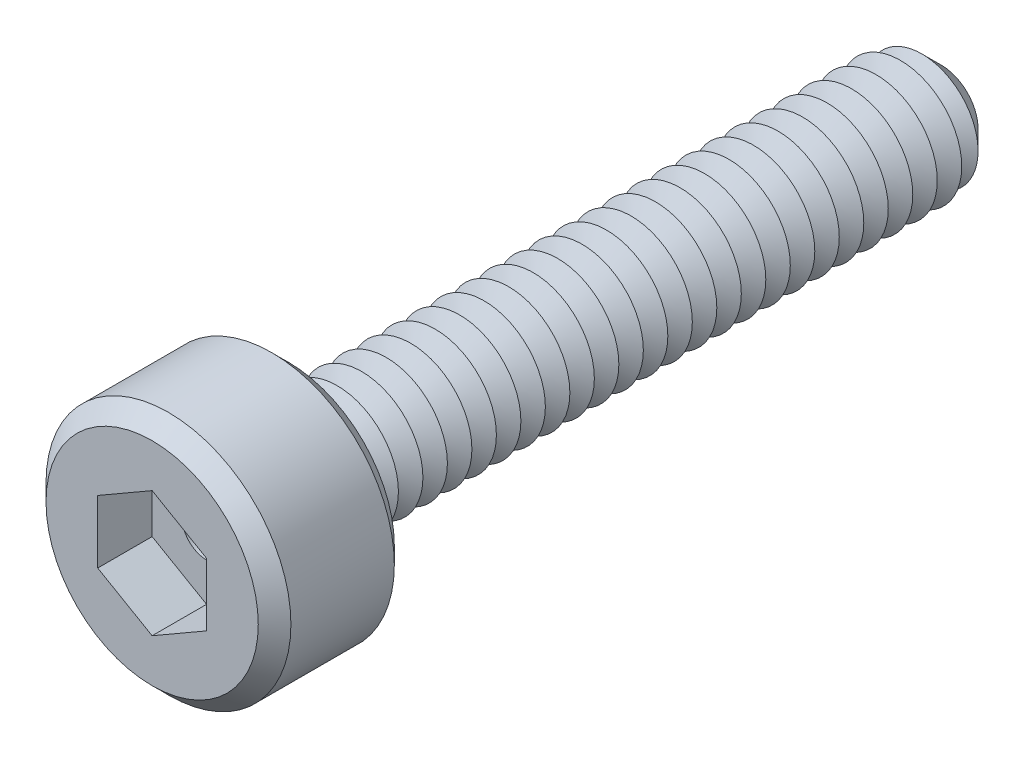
from build123d import *

# Parameters (mm, degrees)
SKETCH1_R           = 2.25
BOSS_EXTRUDE1_DEPTH = 2.5
SKETCH2_R           = 1.125
BOSS_EXTRUDE2_DEPTH = 12
CHAMFER1_SIZE       = 0.45
LPATTERN1_COUNT     = 26
LPATTERN1_PITCH     = 0.45
CUT_EXTRUDE1_DEPTH  = 1
SKETCH6_R           = 0.45
CUT_EXTRUDE2_DEPTH  = 13.5
CHAMFER2_SIZE       = 0.3


with BuildPart() as part:
    # Sketch1 → Boss-Extrude1 (new body)
    with BuildSketch(Plane.XY):
        Circle(SKETCH1_R)
    extrude(amount=BOSS_EXTRUDE1_DEPTH)

    # Sketch2 → Boss-Extrude2 (add)
    with BuildSketch(Plane(origin=(0, 0, 0), x_dir=(-1, 0, 0), z_dir=(0, 0, -1))):
        Circle(SKETCH2_R)
    extrude(amount=BOSS_EXTRUDE2_DEPTH)

    # Chamfer1
    chamfer1_edges = [part.edges().sort_by_distance(p)[0] for p in [
        (1.125, 0, -12),
    ]]
    chamfer(chamfer1_edges, length=CHAMFER1_SIZE)

    # Sketch4 → Cut-Revolve1 (revolve, cut)
    with BuildSketch(Plane(origin=(0, 0, 0), x_dir=(0, 0, -1), z_dir=(1, 0, 0)), mode=Mode.PRIVATE) as cut_revolve1_sk:
        Polygon((0, 1.125), (0.225, 0.735288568), (0.45, 1.125), align=None)
    cut_revolve1 = revolve(cut_revolve1_sk.sketch.rotate(Axis((0, 0, 2.512122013), (0, 0, -1)), 90), axis=Axis((0, 0, 2.512122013), (0, 0, -1)), mode=Mode.SUBTRACT)

    # LPattern1: Cut-Revolve1 ×26
    with Locations(*[(0, 0, -i * LPATTERN1_PITCH) for i in range(1, LPATTERN1_COUNT)]):
        add(cut_revolve1, mode=Mode.SUBTRACT)

    # Sketch5 → Cut-Extrude1 (cut)
    with BuildSketch(Plane.XY.offset(2.5)):
        Polygon((0, 1.154700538), (-1, 0.577350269), (-1, -0.577350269), (0, -1.154700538), (1, -0.577350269), (1, 0.577350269), align=None)
    extrude(amount=-CUT_EXTRUDE1_DEPTH, mode=Mode.SUBTRACT)

    # Sketch6 → Cut-Extrude2 (cut)
    with BuildSketch(Plane.XY.offset(1.5)):
        Circle(SKETCH6_R)
    extrude(amount=-CUT_EXTRUDE2_DEPTH, mode=Mode.SUBTRACT)

    # Chamfer2
    chamfer2_edges = [part.edges().sort_by_distance(p)[0] for p in [
        (-2.25, 0, 0),
        (-2.25, 0, 2.5),
    ]]
    chamfer(chamfer2_edges, length=CHAMFER2_SIZE)


solid = part.part
